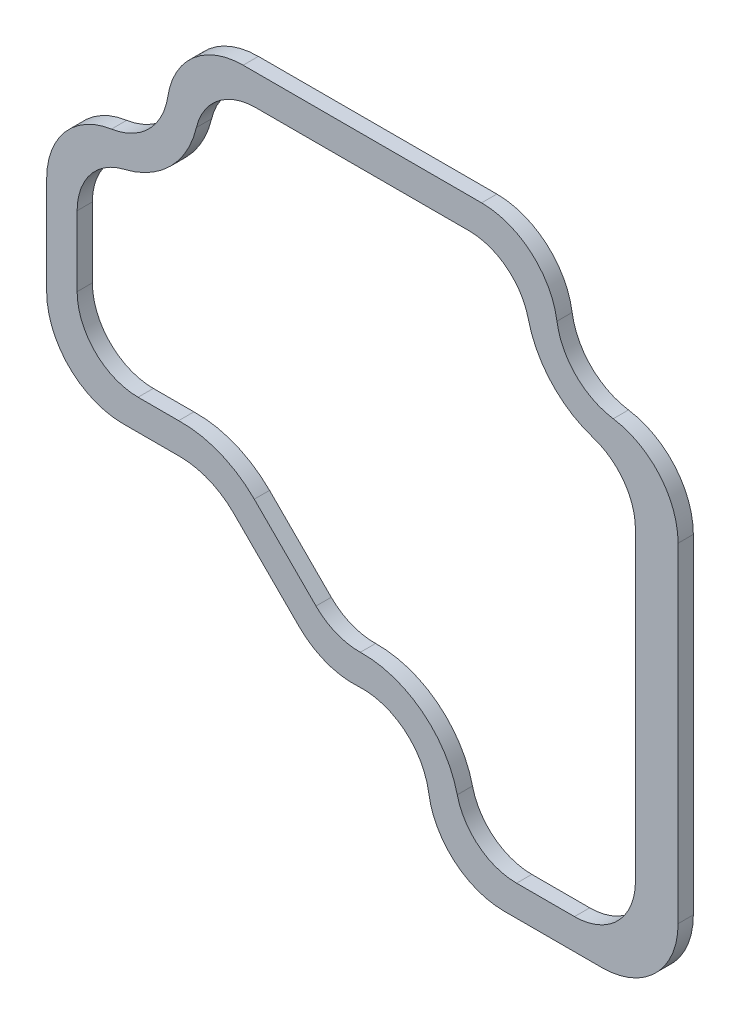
ISO-10303-21;
HEADER;
FILE_DESCRIPTION(('STEP AP214'),'2;1');
FILE_NAME('part.step','',(''),(''),'','','');
FILE_SCHEMA(('AUTOMOTIVE_DESIGN { 1 0 10303 214 1 1 1 1 }'));
ENDSEC;
DATA;
#1=APPLICATION_CONTEXT('core data for automotive mechanical design processes');
#2=APPLICATION_PROTOCOL_DEFINITION('international standard','automotive_design',2000,#1);
#3=PRODUCT_CONTEXT('',#1,'mechanical');
#4=PRODUCT('Part','Part','',(#3));
#5=PRODUCT_RELATED_PRODUCT_CATEGORY('part','',(#4));
#6=PRODUCT_DEFINITION_FORMATION('','',#4);
#7=PRODUCT_DEFINITION_CONTEXT('part definition',#1,'design');
#8=PRODUCT_DEFINITION('design','',#6,#7);
#9=PRODUCT_DEFINITION_SHAPE('','',#8);
#10=(LENGTH_UNIT() NAMED_UNIT(*) SI_UNIT(.MILLI.,.METRE.));
#11=(NAMED_UNIT(*) PLANE_ANGLE_UNIT() SI_UNIT($,.RADIAN.));
#12=(NAMED_UNIT(*) SI_UNIT($,.STERADIAN.) SOLID_ANGLE_UNIT());
#13=UNCERTAINTY_MEASURE_WITH_UNIT(LENGTH_MEASURE(1.E-05),#10,'distance_accuracy_value','');
#14=(GEOMETRIC_REPRESENTATION_CONTEXT(3) GLOBAL_UNCERTAINTY_ASSIGNED_CONTEXT((#13)) GLOBAL_UNIT_ASSIGNED_CONTEXT((#10,
#11,#12)) REPRESENTATION_CONTEXT('',''));
#15=CARTESIAN_POINT('',(0.,0.,0.));
#16=DIRECTION('',(0.,0.,1.));
#17=DIRECTION('',(1.,0.,0.));
#18=AXIS2_PLACEMENT_3D('',#15,#16,#17);
#19=CARTESIAN_POINT('',(24.9555,10.8979334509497,1.5875));
#20=DIRECTION('',(0.,0.,1.));
#21=DIRECTION('',(1.,0.,0.));
#22=AXIS2_PLACEMENT_3D('',#19,#20,#21);
#23=PLANE('',#22);
#24=CARTESIAN_POINT('',(24.9555,10.8979334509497,1.5875));
#25=DIRECTION('',(0.,0.,1.));
#26=DIRECTION('',(1.,0.,0.));
#27=AXIS2_PLACEMENT_3D('',#24,#25,#26);
#28=CIRCLE('',#27,7.9375);
#29=CARTESIAN_POINT('',(32.893,10.8979334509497,1.5875));
#30=VERTEX_POINT('',#29);
#31=CARTESIAN_POINT('',(26.1376808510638,18.7469050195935,1.5875));
#32=VERTEX_POINT('',#31);
#33=EDGE_CURVE('E398',#30,#32,#28,.T.);
#34=ORIENTED_EDGE('',*,*,#33,.T.);
#35=CARTESIAN_POINT('',(27.178,25.654,1.5875));
#36=DIRECTION('',(0.,0.,-1.));
#37=DIRECTION('',(1.,0.,0.));
#38=AXIS2_PLACEMENT_3D('',#35,#36,#37);
#39=CIRCLE('',#38,6.985);
#40=CARTESIAN_POINT('',(20.2709050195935,24.6136808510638,1.5875));
#41=VERTEX_POINT('',#40);
#42=EDGE_CURVE('E403',#32,#41,#39,.T.);
#43=ORIENTED_EDGE('',*,*,#42,.T.);
#44=CARTESIAN_POINT('',(12.4219334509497,23.4315,1.5875));
#45=DIRECTION('',(0.,0.,1.));
#46=DIRECTION('',(1.,0.,0.));
#47=AXIS2_PLACEMENT_3D('',#44,#45,#46);
#48=CIRCLE('',#47,7.93750000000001);
#49=CARTESIAN_POINT('',(12.4219334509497,31.369,1.5875));
#50=VERTEX_POINT('',#49);
#51=EDGE_CURVE('E413',#41,#50,#48,.T.);
#52=ORIENTED_EDGE('',*,*,#51,.T.);
#53=DIRECTION('',(-1.,0.,0.));
#54=VECTOR('',#53,1.);
#55=CARTESIAN_POINT('',(-12.4219334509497,31.369,1.5875));
#56=LINE('',#55,#54);
#57=CARTESIAN_POINT('',(-12.4219334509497,31.369,1.5875));
#58=VERTEX_POINT('',#57);
#59=EDGE_CURVE('E416',#50,#58,#56,.T.);
#60=ORIENTED_EDGE('',*,*,#59,.T.);
#61=CARTESIAN_POINT('',(-12.4219334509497,23.4315,1.5875));
#62=DIRECTION('',(0.,0.,1.));
#63=DIRECTION('',(1.,0.,0.));
#64=AXIS2_PLACEMENT_3D('',#61,#62,#63);
#65=CIRCLE('',#64,7.9375);
#66=CARTESIAN_POINT('',(-20.2709050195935,24.6136808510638,1.5875));
#67=VERTEX_POINT('',#66);
#68=EDGE_CURVE('E420',#58,#67,#65,.T.);
#69=ORIENTED_EDGE('',*,*,#68,.T.);
#70=CARTESIAN_POINT('',(-27.178,25.654,1.5875));
#71=DIRECTION('',(0.,0.,-1.));
#72=DIRECTION('',(1.,0.,0.));
#73=AXIS2_PLACEMENT_3D('',#70,#71,#72);
#74=CIRCLE('',#73,6.985);
#75=CARTESIAN_POINT('',(-26.1376808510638,18.7469050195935,1.5875));
#76=VERTEX_POINT('',#75);
#77=EDGE_CURVE('E424',#67,#76,#74,.T.);
#78=ORIENTED_EDGE('',*,*,#77,.T.);
#79=CARTESIAN_POINT('',(-24.9555,10.8979334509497,1.5875));
#80=DIRECTION('',(0.,0.,1.));
#81=DIRECTION('',(1.,0.,0.));
#82=AXIS2_PLACEMENT_3D('',#79,#80,#81);
#83=CIRCLE('',#82,7.9375);
#84=CARTESIAN_POINT('',(-32.893,10.8979334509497,1.5875));
#85=VERTEX_POINT('',#84);
#86=EDGE_CURVE('E432',#76,#85,#83,.T.);
#87=ORIENTED_EDGE('',*,*,#86,.T.);
#88=DIRECTION('',(0.,-1.,0.));
#89=VECTOR('',#88,1.);
#90=CARTESIAN_POINT('',(-32.893,0.698499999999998,1.5875));
#91=LINE('',#90,#89);
#92=CARTESIAN_POINT('',(-32.893,0.698499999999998,1.5875));
#93=VERTEX_POINT('',#92);
#94=EDGE_CURVE('E435',#85,#93,#91,.T.);
#95=ORIENTED_EDGE('',*,*,#94,.T.);
#96=CARTESIAN_POINT('',(-24.9555,0.698499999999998,1.5875));
#97=DIRECTION('',(0.,0.,1.));
#98=DIRECTION('',(1.,0.,0.));
#99=AXIS2_PLACEMENT_3D('',#96,#97,#98);
#100=CIRCLE('',#99,7.9375);
#101=CARTESIAN_POINT('',(-24.9555,-7.23900000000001,1.5875));
#102=VERTEX_POINT('',#101);
#103=EDGE_CURVE('E439',#93,#102,#100,.T.);
#104=ORIENTED_EDGE('',*,*,#103,.T.);
#105=DIRECTION('',(1.,0.,0.));
#106=VECTOR('',#105,1.);
#107=CARTESIAN_POINT('',(-19.0087433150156,-7.23900000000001,1.5875));
#108=LINE('',#107,#106);
#109=CARTESIAN_POINT('',(-19.0087433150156,-7.23900000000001,1.5875));
#110=VERTEX_POINT('',#109);
#111=EDGE_CURVE('E443',#102,#110,#108,.T.);
#112=ORIENTED_EDGE('',*,*,#111,.T.);
#113=CARTESIAN_POINT('',(-19.0087433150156,-15.1765,1.5875));
#114=DIRECTION('',(0.,0.,-1.));
#115=DIRECTION('',(1.,0.,0.));
#116=AXIS2_PLACEMENT_3D('',#113,#114,#115);
#117=CIRCLE('',#116,7.9375);
#118=CARTESIAN_POINT('',(-13.3960832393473,-9.56383992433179,1.5875));
#119=VERTEX_POINT('',#118);
#120=EDGE_CURVE('E451',#110,#119,#117,.T.);
#121=ORIENTED_EDGE('',*,*,#120,.T.);
#122=DIRECTION('',(0.707106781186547,-0.707106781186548,0.));
#123=VECTOR('',#122,1.);
#124=CARTESIAN_POINT('',(-6.58410903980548,-16.3758141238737,1.5875));
#125=LINE('',#124,#123);
#126=CARTESIAN_POINT('',(-6.58410903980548,-16.3758141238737,1.5875));
#127=VERTEX_POINT('',#126);
#128=EDGE_CURVE('E454',#119,#127,#125,.T.);
#129=ORIENTED_EDGE('',*,*,#128,.T.);
#130=CARTESIAN_POINT('',(-0.971448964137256,-10.7631540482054,1.5875));
#131=DIRECTION('',(0.,0.,1.));
#132=DIRECTION('',(1.,0.,0.));
#133=AXIS2_PLACEMENT_3D('',#130,#131,#132);
#134=CIRCLE('',#133,7.9375);
#135=CARTESIAN_POINT('',(-0.454720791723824,-18.6838167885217,1.5875));
#136=VERTEX_POINT('',#135);
#137=EDGE_CURVE('E458',#127,#136,#134,.T.);
#138=ORIENTED_EDGE('',*,*,#137,.T.);
#139=CARTESIAN_POINT('',(0.,-25.654,1.5875));
#140=DIRECTION('',(0.,0.,-1.));
#141=DIRECTION('',(1.,0.,0.));
#142=AXIS2_PLACEMENT_3D('',#139,#140,#141);
#143=CIRCLE('',#142,6.985);
#144=CARTESIAN_POINT('',(6.9070949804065,-24.6136808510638,1.5875));
#145=VERTEX_POINT('',#144);
#146=EDGE_CURVE('E462',#136,#145,#143,.T.);
#147=ORIENTED_EDGE('',*,*,#146,.T.);
#148=CARTESIAN_POINT('',(14.7560665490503,-23.4315,1.5875));
#149=DIRECTION('',(0.,0.,1.));
#150=DIRECTION('',(1.,0.,0.));
#151=AXIS2_PLACEMENT_3D('',#148,#149,#150);
#152=CIRCLE('',#151,7.9375);
#153=CARTESIAN_POINT('',(14.7560665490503,-31.369,1.5875));
#154=VERTEX_POINT('',#153);
#155=EDGE_CURVE('E469',#145,#154,#152,.T.);
#156=ORIENTED_EDGE('',*,*,#155,.T.);
#157=DIRECTION('',(1.,0.,0.));
#158=VECTOR('',#157,1.);
#159=CARTESIAN_POINT('',(14.7560665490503,-31.369,1.5875));
#160=LINE('',#159,#158);
#161=CARTESIAN_POINT('',(24.9555,-31.369,1.5875));
#162=VERTEX_POINT('',#161);
#163=EDGE_CURVE('E472',#154,#162,#160,.T.);
#164=ORIENTED_EDGE('',*,*,#163,.T.);
#165=CARTESIAN_POINT('',(24.9555,-23.4315,1.5875));
#166=DIRECTION('',(0.,0.,1.));
#167=DIRECTION('',(1.,0.,0.));
#168=AXIS2_PLACEMENT_3D('',#165,#166,#167);
#169=CIRCLE('',#168,7.9375);
#170=CARTESIAN_POINT('',(32.893,-23.4315,1.5875));
#171=VERTEX_POINT('',#170);
#172=EDGE_CURVE('E476',#162,#171,#169,.T.);
#173=ORIENTED_EDGE('',*,*,#172,.T.);
#174=DIRECTION('',(0.,1.,0.));
#175=VECTOR('',#174,1.);
#176=CARTESIAN_POINT('',(32.893,-23.4315,1.5875));
#177=LINE('',#176,#175);
#178=EDGE_CURVE('E479',#171,#30,#177,.T.);
#179=ORIENTED_EDGE('',*,*,#178,.T.);
#180=EDGE_LOOP('',(#34,#43,#52,#60,#69,#78,#87,#95,#104,#112,#121,#129,#138,#147,#156,#164,#173,#179));
#181=FACE_BOUND('',#180,.T.);
#182=DIRECTION('',(0.707106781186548,-0.707106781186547,0.));
#183=VECTOR('',#182,1.);
#184=CARTESIAN_POINT('',(-4.83212451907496,-13.6376705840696,1.5875));
#185=LINE('',#184,#183);
#186=CARTESIAN_POINT('',(-11.2615611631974,-7.20823393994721,1.5875));
#187=VERTEX_POINT('',#186);
#188=CARTESIAN_POINT('',(-4.83212451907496,-13.6376705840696,1.5875));
#189=VERTEX_POINT('',#188);
#190=EDGE_CURVE('E278',#187,#189,#185,.T.);
#191=ORIENTED_EDGE('',*,*,#190,.F.);
#192=CARTESIAN_POINT('',(-18.8612224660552,-14.807895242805,1.5875));
#193=DIRECTION('',(0.,0.,-1.));
#194=DIRECTION('',(1.,0.,0.));
#195=AXIS2_PLACEMENT_3D('',#192,#193,#194);
#196=CIRCLE('',#195,10.7475440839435);
#197=CARTESIAN_POINT('',(-19.1412561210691,-4.064,1.5875));
#198=VERTEX_POINT('',#197);
#199=EDGE_CURVE('E269',#198,#187,#196,.T.);
#200=ORIENTED_EDGE('',*,*,#199,.F.);
#201=DIRECTION('',(1.,0.,0.));
#202=VECTOR('',#201,1.);
#203=CARTESIAN_POINT('',(-19.1412561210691,-4.064,1.5875));
#204=LINE('',#203,#202);
#205=CARTESIAN_POINT('',(-23.368,-4.064,1.5875));
#206=VERTEX_POINT('',#205);
#207=EDGE_CURVE('E311',#206,#198,#204,.T.);
#208=ORIENTED_EDGE('',*,*,#207,.F.);
#209=CARTESIAN_POINT('',(-23.368,2.28599999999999,1.5875));
#210=DIRECTION('',(0.,0.,1.));
#211=DIRECTION('',(-1.,0.,0.));
#212=AXIS2_PLACEMENT_3D('',#209,#210,#211);
#213=CIRCLE('',#212,6.34999999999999);
#214=CARTESIAN_POINT('',(-29.718,2.28599999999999,1.5875));
#215=VERTEX_POINT('',#214);
#216=EDGE_CURVE('E315',#215,#206,#213,.T.);
#217=ORIENTED_EDGE('',*,*,#216,.F.);
#218=DIRECTION('',(0.,-1.,0.));
#219=VECTOR('',#218,1.);
#220=CARTESIAN_POINT('',(-29.718,2.28599999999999,1.5875));
#221=LINE('',#220,#219);
#222=CARTESIAN_POINT('',(-29.718,9.58962948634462,1.5875));
#223=VERTEX_POINT('',#222);
#224=EDGE_CURVE('E980',#223,#215,#221,.T.);
#225=ORIENTED_EDGE('',*,*,#224,.F.);
#226=CARTESIAN_POINT('',(-23.368,9.58962948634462,1.5875));
#227=DIRECTION('',(0.,0.,1.));
#228=DIRECTION('',(-1.,0.,0.));
#229=AXIS2_PLACEMENT_3D('',#226,#227,#228);
#230=CIRCLE('',#229,6.35000000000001);
#231=CARTESIAN_POINT('',(-24.8333846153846,15.7682335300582,1.5875));
#232=VERTEX_POINT('',#231);
#233=EDGE_CURVE('E982',#232,#223,#230,.T.);
#234=ORIENTED_EDGE('',*,*,#233,.F.);
#235=CARTESIAN_POINT('',(-27.178,25.654,1.5875));
#236=DIRECTION('',(0.,0.,-1.));
#237=DIRECTION('',(1.,0.,0.));
#238=AXIS2_PLACEMENT_3D('',#235,#236,#237);
#239=CIRCLE('',#238,10.16);
#240=CARTESIAN_POINT('',(-17.2922335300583,23.3093846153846,1.5875));
#241=VERTEX_POINT('',#240);
#242=EDGE_CURVE('E985',#241,#232,#239,.T.);
#243=ORIENTED_EDGE('',*,*,#242,.F.);
#244=CARTESIAN_POINT('',(-11.1136294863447,21.844,1.5875));
#245=DIRECTION('',(0.,0.,1.));
#246=DIRECTION('',(-1.,0.,0.));
#247=AXIS2_PLACEMENT_3D('',#244,#245,#246);
#248=CIRCLE('',#247,6.34999999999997);
#249=CARTESIAN_POINT('',(-11.1136294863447,28.194,1.5875));
#250=VERTEX_POINT('',#249);
#251=EDGE_CURVE('E997',#250,#241,#248,.T.);
#252=ORIENTED_EDGE('',*,*,#251,.F.);
#253=DIRECTION('',(-1.,0.,0.));
#254=VECTOR('',#253,1.);
#255=CARTESIAN_POINT('',(-11.1136294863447,28.194,1.5875));
#256=LINE('',#255,#254);
#257=CARTESIAN_POINT('',(11.1136294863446,28.194,1.5875));
#258=VERTEX_POINT('',#257);
#259=EDGE_CURVE('E1001',#258,#250,#256,.T.);
#260=ORIENTED_EDGE('',*,*,#259,.F.);
#261=CARTESIAN_POINT('',(11.1136294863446,21.844,1.5875));
#262=DIRECTION('',(0.,0.,1.));
#263=DIRECTION('',(-1.,0.,0.));
#264=AXIS2_PLACEMENT_3D('',#261,#262,#263);
#265=CIRCLE('',#264,6.34999999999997);
#266=CARTESIAN_POINT('',(17.2922335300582,23.3093846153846,1.5875));
#267=VERTEX_POINT('',#266);
#268=EDGE_CURVE('E1005',#267,#258,#265,.T.);
#269=ORIENTED_EDGE('',*,*,#268,.F.);
#270=CARTESIAN_POINT('',(27.1779999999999,25.654,1.5875));
#271=DIRECTION('',(0.,0.,-1.));
#272=DIRECTION('',(1.,0.,0.));
#273=AXIS2_PLACEMENT_3D('',#270,#271,#272);
#274=CIRCLE('',#273,10.16);
#275=CARTESIAN_POINT('',(24.0518461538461,15.9869031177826,1.5875));
#276=VERTEX_POINT('',#275);
#277=EDGE_CURVE('E1013',#276,#267,#274,.T.);
#278=ORIENTED_EDGE('',*,*,#277,.F.);
#279=CARTESIAN_POINT('',(22.098,9.94496756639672,1.5875));
#280=DIRECTION('',(0.,0.,1.));
#281=DIRECTION('',(-1.,0.,0.));
#282=AXIS2_PLACEMENT_3D('',#279,#280,#281);
#283=CIRCLE('',#282,6.34999999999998);
#284=CARTESIAN_POINT('',(28.448,9.94496756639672,1.5875));
#285=VERTEX_POINT('',#284);
#286=EDGE_CURVE('E1016',#285,#276,#283,.T.);
#287=ORIENTED_EDGE('',*,*,#286,.F.);
#288=DIRECTION('',(0.,1.,0.));
#289=VECTOR('',#288,1.);
#290=CARTESIAN_POINT('',(28.448,9.94496756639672,1.5875));
#291=LINE('',#290,#289);
#292=CARTESIAN_POINT('',(28.448,-21.844,1.5875));
#293=VERTEX_POINT('',#292);
#294=EDGE_CURVE('E1020',#293,#285,#291,.T.);
#295=ORIENTED_EDGE('',*,*,#294,.F.);
#296=CARTESIAN_POINT('',(22.098,-21.844,1.5875));
#297=DIRECTION('',(0.,0.,1.));
#298=DIRECTION('',(-1.,0.,0.));
#299=AXIS2_PLACEMENT_3D('',#296,#297,#298);
#300=CIRCLE('',#299,6.34999999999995);
#301=CARTESIAN_POINT('',(22.098,-28.194,1.5875));
#302=VERTEX_POINT('',#301);
#303=EDGE_CURVE('E1024',#302,#293,#300,.T.);
#304=ORIENTED_EDGE('',*,*,#303,.F.);
#305=DIRECTION('',(1.,0.,0.));
#306=VECTOR('',#305,1.);
#307=CARTESIAN_POINT('',(22.098,-28.194,1.5875));
#308=LINE('',#307,#306);
#309=CARTESIAN_POINT('',(16.0643705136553,-28.194,1.5875));
#310=VERTEX_POINT('',#309);
#311=EDGE_CURVE('E1031',#310,#302,#308,.T.);
#312=ORIENTED_EDGE('',*,*,#311,.F.);
#313=CARTESIAN_POINT('',(16.0643705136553,-21.844,1.5875));
#314=DIRECTION('',(0.,0.,1.));
#315=DIRECTION('',(-1.,0.,0.));
#316=AXIS2_PLACEMENT_3D('',#313,#314,#315);
#317=CIRCLE('',#316,6.35);
#318=CARTESIAN_POINT('',(9.88576646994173,-23.3093846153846,1.5875));
#319=VERTEX_POINT('',#318);
#320=EDGE_CURVE('E1034',#319,#310,#317,.T.);
#321=ORIENTED_EDGE('',*,*,#320,.F.);
#322=CARTESIAN_POINT('',(0.,-25.654,1.5875));
#323=DIRECTION('',(0.,0.,-1.));
#324=DIRECTION('',(1.,0.,0.));
#325=AXIS2_PLACEMENT_3D('',#322,#323,#324);
#326=CIRCLE('',#325,10.16);
#327=CARTESIAN_POINT('',(-0.21045935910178,-15.4961800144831,1.5875));
#328=VERTEX_POINT('',#327);
#329=EDGE_CURVE('E296',#328,#319,#326,.T.);
#330=ORIENTED_EDGE('',*,*,#329,.F.);
#331=CARTESIAN_POINT('',(-0.341996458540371,-9.147542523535,1.5875));
#332=DIRECTION('',(0.,0.,1.));
#333=DIRECTION('',(-1.,0.,0.));
#334=AXIS2_PLACEMENT_3D('',#331,#332,#333);
#335=CIRCLE('',#334,6.35000000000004);
#336=EDGE_CURVE('E291',#189,#328,#335,.T.);
#337=ORIENTED_EDGE('',*,*,#336,.F.);
#338=EDGE_LOOP('',(#191,#200,#208,#217,#225,#234,#243,#252,#260,#269,#278,#287,#295,#304,#312,
#321,#330,#337));
#339=FACE_BOUND('',#338,.T.);
#340=ADVANCED_FACE('F36',(#181,#339),#23,.T.);
#341=CARTESIAN_POINT('',(24.9555,10.8979334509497,0.));
#342=DIRECTION('',(0.,0.,1.));
#343=DIRECTION('',(1.,0.,0.));
#344=AXIS2_PLACEMENT_3D('',#341,#342,#343);
#345=PLANE('',#344);
#346=CARTESIAN_POINT('',(24.9555,10.8979334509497,0.));
#347=DIRECTION('',(0.,0.,1.));
#348=DIRECTION('',(1.,0.,0.));
#349=AXIS2_PLACEMENT_3D('',#346,#347,#348);
#350=CIRCLE('',#349,7.9375);
#351=CARTESIAN_POINT('',(32.893,10.8979334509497,0.));
#352=VERTEX_POINT('',#351);
#353=CARTESIAN_POINT('',(26.1376808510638,18.7469050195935,0.));
#354=VERTEX_POINT('',#353);
#355=EDGE_CURVE('E286',#352,#354,#350,.T.);
#356=ORIENTED_EDGE('',*,*,#355,.F.);
#357=DIRECTION('',(0.,1.,0.));
#358=VECTOR('',#357,1.);
#359=CARTESIAN_POINT('',(32.893,-23.4315,0.));
#360=LINE('',#359,#358);
#361=CARTESIAN_POINT('',(32.893,-23.4315,0.));
#362=VERTEX_POINT('',#361);
#363=EDGE_CURVE('E404',#362,#352,#360,.T.);
#364=ORIENTED_EDGE('',*,*,#363,.F.);
#365=CARTESIAN_POINT('',(24.9555,-23.4315,0.));
#366=DIRECTION('',(0.,0.,1.));
#367=DIRECTION('',(1.,0.,0.));
#368=AXIS2_PLACEMENT_3D('',#365,#366,#367);
#369=CIRCLE('',#368,7.9375);
#370=CARTESIAN_POINT('',(24.9555,-31.369,0.));
#371=VERTEX_POINT('',#370);
#372=EDGE_CURVE('E515',#371,#362,#369,.T.);
#373=ORIENTED_EDGE('',*,*,#372,.F.);
#374=DIRECTION('',(1.,0.,0.));
#375=VECTOR('',#374,1.);
#376=CARTESIAN_POINT('',(14.7560665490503,-31.369,0.));
#377=LINE('',#376,#375);
#378=CARTESIAN_POINT('',(14.7560665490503,-31.369,0.));
#379=VERTEX_POINT('',#378);
#380=EDGE_CURVE('E513',#379,#371,#377,.T.);
#381=ORIENTED_EDGE('',*,*,#380,.F.);
#382=CARTESIAN_POINT('',(14.7560665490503,-23.4315,0.));
#383=DIRECTION('',(0.,0.,1.));
#384=DIRECTION('',(1.,0.,0.));
#385=AXIS2_PLACEMENT_3D('',#382,#383,#384);
#386=CIRCLE('',#385,7.9375);
#387=CARTESIAN_POINT('',(6.9070949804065,-24.6136808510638,0.));
#388=VERTEX_POINT('',#387);
#389=EDGE_CURVE('E511',#388,#379,#386,.T.);
#390=ORIENTED_EDGE('',*,*,#389,.F.);
#391=CARTESIAN_POINT('',(0.,-25.654,0.));
#392=DIRECTION('',(0.,0.,-1.));
#393=DIRECTION('',(1.,0.,0.));
#394=AXIS2_PLACEMENT_3D('',#391,#392,#393);
#395=CIRCLE('',#394,6.985);
#396=CARTESIAN_POINT('',(-0.454720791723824,-18.6838167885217,0.));
#397=VERTEX_POINT('',#396);
#398=EDGE_CURVE('E509',#397,#388,#395,.T.);
#399=ORIENTED_EDGE('',*,*,#398,.F.);
#400=CARTESIAN_POINT('',(-0.971448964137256,-10.7631540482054,0.));
#401=DIRECTION('',(0.,0.,1.));
#402=DIRECTION('',(1.,0.,0.));
#403=AXIS2_PLACEMENT_3D('',#400,#401,#402);
#404=CIRCLE('',#403,7.9375);
#405=CARTESIAN_POINT('',(-6.58410903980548,-16.3758141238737,0.));
#406=VERTEX_POINT('',#405);
#407=EDGE_CURVE('E507',#406,#397,#404,.T.);
#408=ORIENTED_EDGE('',*,*,#407,.F.);
#409=DIRECTION('',(0.707106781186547,-0.707106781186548,0.));
#410=VECTOR('',#409,1.);
#411=CARTESIAN_POINT('',(-6.58410903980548,-16.3758141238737,0.));
#412=LINE('',#411,#410);
#413=CARTESIAN_POINT('',(-13.3960832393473,-9.56383992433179,0.));
#414=VERTEX_POINT('',#413);
#415=EDGE_CURVE('E505',#414,#406,#412,.T.);
#416=ORIENTED_EDGE('',*,*,#415,.F.);
#417=CARTESIAN_POINT('',(-19.0087433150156,-15.1765,0.));
#418=DIRECTION('',(0.,0.,-1.));
#419=DIRECTION('',(1.,0.,0.));
#420=AXIS2_PLACEMENT_3D('',#417,#418,#419);
#421=CIRCLE('',#420,7.9375);
#422=CARTESIAN_POINT('',(-19.0087433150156,-7.23900000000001,0.));
#423=VERTEX_POINT('',#422);
#424=EDGE_CURVE('E503',#423,#414,#421,.T.);
#425=ORIENTED_EDGE('',*,*,#424,.F.);
#426=DIRECTION('',(1.,0.,0.));
#427=VECTOR('',#426,1.);
#428=CARTESIAN_POINT('',(-19.0087433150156,-7.23900000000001,0.));
#429=LINE('',#428,#427);
#430=CARTESIAN_POINT('',(-24.9555,-7.23900000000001,0.));
#431=VERTEX_POINT('',#430);
#432=EDGE_CURVE('E501',#431,#423,#429,.T.);
#433=ORIENTED_EDGE('',*,*,#432,.F.);
#434=CARTESIAN_POINT('',(-24.9555,0.698499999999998,0.));
#435=DIRECTION('',(0.,0.,1.));
#436=DIRECTION('',(1.,0.,0.));
#437=AXIS2_PLACEMENT_3D('',#434,#435,#436);
#438=CIRCLE('',#437,7.9375);
#439=CARTESIAN_POINT('',(-32.893,0.698499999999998,0.));
#440=VERTEX_POINT('',#439);
#441=EDGE_CURVE('E499',#440,#431,#438,.T.);
#442=ORIENTED_EDGE('',*,*,#441,.F.);
#443=DIRECTION('',(0.,-1.,0.));
#444=VECTOR('',#443,1.);
#445=CARTESIAN_POINT('',(-32.893,0.698499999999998,0.));
#446=LINE('',#445,#444);
#447=CARTESIAN_POINT('',(-32.893,10.8979334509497,0.));
#448=VERTEX_POINT('',#447);
#449=EDGE_CURVE('E497',#448,#440,#446,.T.);
#450=ORIENTED_EDGE('',*,*,#449,.F.);
#451=CARTESIAN_POINT('',(-24.9555,10.8979334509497,0.));
#452=DIRECTION('',(0.,0.,1.));
#453=DIRECTION('',(1.,0.,0.));
#454=AXIS2_PLACEMENT_3D('',#451,#452,#453);
#455=CIRCLE('',#454,7.9375);
#456=CARTESIAN_POINT('',(-26.1376808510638,18.7469050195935,0.));
#457=VERTEX_POINT('',#456);
#458=EDGE_CURVE('E495',#457,#448,#455,.T.);
#459=ORIENTED_EDGE('',*,*,#458,.F.);
#460=CARTESIAN_POINT('',(-27.178,25.654,0.));
#461=DIRECTION('',(0.,0.,-1.));
#462=DIRECTION('',(1.,0.,0.));
#463=AXIS2_PLACEMENT_3D('',#460,#461,#462);
#464=CIRCLE('',#463,6.985);
#465=CARTESIAN_POINT('',(-20.2709050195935,24.6136808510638,0.));
#466=VERTEX_POINT('',#465);
#467=EDGE_CURVE('E493',#466,#457,#464,.T.);
#468=ORIENTED_EDGE('',*,*,#467,.F.);
#469=CARTESIAN_POINT('',(-12.4219334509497,23.4315,0.));
#470=DIRECTION('',(0.,0.,1.));
#471=DIRECTION('',(1.,0.,0.));
#472=AXIS2_PLACEMENT_3D('',#469,#470,#471);
#473=CIRCLE('',#472,7.9375);
#474=CARTESIAN_POINT('',(-12.4219334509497,31.369,0.));
#475=VERTEX_POINT('',#474);
#476=EDGE_CURVE('E491',#475,#466,#473,.T.);
#477=ORIENTED_EDGE('',*,*,#476,.F.);
#478=DIRECTION('',(-1.,0.,0.));
#479=VECTOR('',#478,1.);
#480=CARTESIAN_POINT('',(-12.4219334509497,31.369,0.));
#481=LINE('',#480,#479);
#482=CARTESIAN_POINT('',(12.4219334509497,31.369,0.));
#483=VERTEX_POINT('',#482);
#484=EDGE_CURVE('E489',#483,#475,#481,.T.);
#485=ORIENTED_EDGE('',*,*,#484,.F.);
#486=CARTESIAN_POINT('',(12.4219334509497,23.4315,0.));
#487=DIRECTION('',(0.,0.,1.));
#488=DIRECTION('',(1.,0.,0.));
#489=AXIS2_PLACEMENT_3D('',#486,#487,#488);
#490=CIRCLE('',#489,7.93750000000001);
#491=CARTESIAN_POINT('',(20.2709050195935,24.6136808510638,0.));
#492=VERTEX_POINT('',#491);
#493=EDGE_CURVE('E487',#492,#483,#490,.T.);
#494=ORIENTED_EDGE('',*,*,#493,.F.);
#495=CARTESIAN_POINT('',(27.178,25.654,0.));
#496=DIRECTION('',(0.,0.,-1.));
#497=DIRECTION('',(1.,0.,0.));
#498=AXIS2_PLACEMENT_3D('',#495,#496,#497);
#499=CIRCLE('',#498,6.985);
#500=EDGE_CURVE('E485',#354,#492,#499,.T.);
#501=ORIENTED_EDGE('',*,*,#500,.F.);
#502=EDGE_LOOP('',(#356,#364,#373,#381,#390,#399,#408,#416,#425,#433,#442,#450,#459,#468,#477,
#485,#494,#501));
#503=FACE_BOUND('',#502,.T.);
#504=CARTESIAN_POINT('',(-18.8612224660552,-14.807895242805,0.));
#505=DIRECTION('',(0.,0.,-1.));
#506=DIRECTION('',(1.,0.,0.));
#507=AXIS2_PLACEMENT_3D('',#504,#505,#506);
#508=CIRCLE('',#507,10.7475440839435);
#509=CARTESIAN_POINT('',(-19.1412561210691,-4.064,0.));
#510=VERTEX_POINT('',#509);
#511=CARTESIAN_POINT('',(-11.2615611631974,-7.20823393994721,0.));
#512=VERTEX_POINT('',#511);
#513=EDGE_CURVE('E59',#510,#512,#508,.T.);
#514=ORIENTED_EDGE('',*,*,#513,.T.);
#515=DIRECTION('',(0.707106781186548,-0.707106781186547,0.));
#516=VECTOR('',#515,1.);
#517=CARTESIAN_POINT('',(-4.83212451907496,-13.6376705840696,0.));
#518=LINE('',#517,#516);
#519=CARTESIAN_POINT('',(-4.83212451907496,-13.6376705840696,0.));
#520=VERTEX_POINT('',#519);
#521=EDGE_CURVE('E285',#512,#520,#518,.T.);
#522=ORIENTED_EDGE('',*,*,#521,.T.);
#523=CARTESIAN_POINT('',(-0.341996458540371,-9.147542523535,0.));
#524=DIRECTION('',(0.,0.,1.));
#525=DIRECTION('',(-1.,0.,0.));
#526=AXIS2_PLACEMENT_3D('',#523,#524,#525);
#527=CIRCLE('',#526,6.35000000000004);
#528=CARTESIAN_POINT('',(-0.21045935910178,-15.4961800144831,0.));
#529=VERTEX_POINT('',#528);
#530=EDGE_CURVE('E320',#520,#529,#527,.T.);
#531=ORIENTED_EDGE('',*,*,#530,.T.);
#532=CARTESIAN_POINT('',(0.,-25.654,0.));
#533=DIRECTION('',(0.,0.,-1.));
#534=DIRECTION('',(1.,0.,0.));
#535=AXIS2_PLACEMENT_3D('',#532,#533,#534);
#536=CIRCLE('',#535,10.16);
#537=CARTESIAN_POINT('',(9.88576646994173,-23.3093846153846,0.));
#538=VERTEX_POINT('',#537);
#539=EDGE_CURVE('E323',#529,#538,#536,.T.);
#540=ORIENTED_EDGE('',*,*,#539,.T.);
#541=CARTESIAN_POINT('',(16.0643705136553,-21.844,0.));
#542=DIRECTION('',(0.,0.,1.));
#543=DIRECTION('',(-1.,0.,0.));
#544=AXIS2_PLACEMENT_3D('',#541,#542,#543);
#545=CIRCLE('',#544,6.35);
#546=CARTESIAN_POINT('',(16.0643705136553,-28.194,0.));
#547=VERTEX_POINT('',#546);
#548=EDGE_CURVE('E326',#538,#547,#545,.T.);
#549=ORIENTED_EDGE('',*,*,#548,.T.);
#550=DIRECTION('',(1.,0.,0.));
#551=VECTOR('',#550,1.);
#552=CARTESIAN_POINT('',(22.098,-28.194,0.));
#553=LINE('',#552,#551);
#554=CARTESIAN_POINT('',(22.098,-28.194,0.));
#555=VERTEX_POINT('',#554);
#556=EDGE_CURVE('E329',#547,#555,#553,.T.);
#557=ORIENTED_EDGE('',*,*,#556,.T.);
#558=CARTESIAN_POINT('',(22.098,-21.844,0.));
#559=DIRECTION('',(0.,0.,1.));
#560=DIRECTION('',(-1.,0.,0.));
#561=AXIS2_PLACEMENT_3D('',#558,#559,#560);
#562=CIRCLE('',#561,6.34999999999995);
#563=CARTESIAN_POINT('',(28.448,-21.844,0.));
#564=VERTEX_POINT('',#563);
#565=EDGE_CURVE('E332',#555,#564,#562,.T.);
#566=ORIENTED_EDGE('',*,*,#565,.T.);
#567=DIRECTION('',(0.,1.,0.));
#568=VECTOR('',#567,1.);
#569=CARTESIAN_POINT('',(28.448,9.94496756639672,0.));
#570=LINE('',#569,#568);
#571=CARTESIAN_POINT('',(28.448,9.94496756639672,0.));
#572=VERTEX_POINT('',#571);
#573=EDGE_CURVE('E335',#564,#572,#570,.T.);
#574=ORIENTED_EDGE('',*,*,#573,.T.);
#575=CARTESIAN_POINT('',(22.098,9.94496756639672,0.));
#576=DIRECTION('',(0.,0.,1.));
#577=DIRECTION('',(-1.,0.,0.));
#578=AXIS2_PLACEMENT_3D('',#575,#576,#577);
#579=CIRCLE('',#578,6.34999999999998);
#580=CARTESIAN_POINT('',(24.0518461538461,15.9869031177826,0.));
#581=VERTEX_POINT('',#580);
#582=EDGE_CURVE('E338',#572,#581,#579,.T.);
#583=ORIENTED_EDGE('',*,*,#582,.T.);
#584=CARTESIAN_POINT('',(27.1779999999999,25.654,0.));
#585=DIRECTION('',(0.,0.,-1.));
#586=DIRECTION('',(1.,0.,0.));
#587=AXIS2_PLACEMENT_3D('',#584,#585,#586);
#588=CIRCLE('',#587,10.16);
#589=CARTESIAN_POINT('',(17.2922335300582,23.3093846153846,0.));
#590=VERTEX_POINT('',#589);
#591=EDGE_CURVE('E341',#581,#590,#588,.T.);
#592=ORIENTED_EDGE('',*,*,#591,.T.);
#593=CARTESIAN_POINT('',(11.1136294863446,21.844,0.));
#594=DIRECTION('',(0.,0.,1.));
#595=DIRECTION('',(-1.,0.,0.));
#596=AXIS2_PLACEMENT_3D('',#593,#594,#595);
#597=CIRCLE('',#596,6.34999999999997);
#598=CARTESIAN_POINT('',(11.1136294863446,28.194,0.));
#599=VERTEX_POINT('',#598);
#600=EDGE_CURVE('E344',#590,#599,#597,.T.);
#601=ORIENTED_EDGE('',*,*,#600,.T.);
#602=DIRECTION('',(-1.,0.,0.));
#603=VECTOR('',#602,1.);
#604=CARTESIAN_POINT('',(-11.1136294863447,28.194,0.));
#605=LINE('',#604,#603);
#606=CARTESIAN_POINT('',(-11.1136294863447,28.194,0.));
#607=VERTEX_POINT('',#606);
#608=EDGE_CURVE('E347',#599,#607,#605,.T.);
#609=ORIENTED_EDGE('',*,*,#608,.T.);
#610=CARTESIAN_POINT('',(-11.1136294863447,21.844,0.));
#611=DIRECTION('',(0.,0.,1.));
#612=DIRECTION('',(-1.,0.,0.));
#613=AXIS2_PLACEMENT_3D('',#610,#611,#612);
#614=CIRCLE('',#613,6.34999999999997);
#615=CARTESIAN_POINT('',(-17.2922335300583,23.3093846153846,0.));
#616=VERTEX_POINT('',#615);
#617=EDGE_CURVE('E350',#607,#616,#614,.T.);
#618=ORIENTED_EDGE('',*,*,#617,.T.);
#619=CARTESIAN_POINT('',(-27.178,25.654,0.));
#620=DIRECTION('',(0.,0.,-1.));
#621=DIRECTION('',(1.,0.,0.));
#622=AXIS2_PLACEMENT_3D('',#619,#620,#621);
#623=CIRCLE('',#622,10.16);
#624=CARTESIAN_POINT('',(-24.8333846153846,15.7682335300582,0.));
#625=VERTEX_POINT('',#624);
#626=EDGE_CURVE('E353',#616,#625,#623,.T.);
#627=ORIENTED_EDGE('',*,*,#626,.T.);
#628=CARTESIAN_POINT('',(-23.368,9.58962948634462,0.));
#629=DIRECTION('',(0.,0.,1.));
#630=DIRECTION('',(-1.,0.,0.));
#631=AXIS2_PLACEMENT_3D('',#628,#629,#630);
#632=CIRCLE('',#631,6.35000000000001);
#633=CARTESIAN_POINT('',(-29.718,9.58962948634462,0.));
#634=VERTEX_POINT('',#633);
#635=EDGE_CURVE('E356',#625,#634,#632,.T.);
#636=ORIENTED_EDGE('',*,*,#635,.T.);
#637=DIRECTION('',(0.,-1.,0.));
#638=VECTOR('',#637,1.);
#639=CARTESIAN_POINT('',(-29.718,2.28599999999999,0.));
#640=LINE('',#639,#638);
#641=CARTESIAN_POINT('',(-29.718,2.28599999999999,0.));
#642=VERTEX_POINT('',#641);
#643=EDGE_CURVE('E359',#634,#642,#640,.T.);
#644=ORIENTED_EDGE('',*,*,#643,.T.);
#645=CARTESIAN_POINT('',(-23.368,2.28599999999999,0.));
#646=DIRECTION('',(0.,0.,1.));
#647=DIRECTION('',(-1.,0.,0.));
#648=AXIS2_PLACEMENT_3D('',#645,#646,#647);
#649=CIRCLE('',#648,6.34999999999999);
#650=CARTESIAN_POINT('',(-23.368,-4.064,0.));
#651=VERTEX_POINT('',#650);
#652=EDGE_CURVE('E362',#642,#651,#649,.T.);
#653=ORIENTED_EDGE('',*,*,#652,.T.);
#654=DIRECTION('',(1.,0.,0.));
#655=VECTOR('',#654,1.);
#656=CARTESIAN_POINT('',(-19.1412561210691,-4.064,0.));
#657=LINE('',#656,#655);
#658=EDGE_CURVE('E279',#651,#510,#657,.T.);
#659=ORIENTED_EDGE('',*,*,#658,.T.);
#660=EDGE_LOOP('',(#514,#522,#531,#540,#549,#557,#566,#574,#583,#592,#601,#609,#618,#627,#636,
#644,#653,#659));
#661=FACE_BOUND('',#660,.T.);
#662=ADVANCED_FACE('F575',(#503,#661),#345,.F.);
#663=CARTESIAN_POINT('',(24.9555,10.8979334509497,1.5875));
#664=DIRECTION('',(0.,0.,-1.));
#665=DIRECTION('',(-1.,0.,0.));
#666=AXIS2_PLACEMENT_3D('',#663,#664,#665);
#667=CYLINDRICAL_SURFACE('',#666,7.9375);
#668=ORIENTED_EDGE('',*,*,#355,.T.);
#669=DIRECTION('',(0.,0.,-1.));
#670=VECTOR('',#669,1.);
#671=CARTESIAN_POINT('',(26.1376808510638,18.7469050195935,1.5875));
#672=LINE('',#671,#670);
#673=EDGE_CURVE('E12',#32,#354,#672,.T.);
#674=ORIENTED_EDGE('',*,*,#673,.F.);
#675=ORIENTED_EDGE('',*,*,#33,.F.);
#676=DIRECTION('',(0.,0.,-1.));
#677=VECTOR('',#676,1.);
#678=CARTESIAN_POINT('',(32.893,10.8979334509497,1.5875));
#679=LINE('',#678,#677);
#680=EDGE_CURVE('E482',#30,#352,#679,.T.);
#681=ORIENTED_EDGE('',*,*,#680,.T.);
#682=EDGE_LOOP('',(#668,#674,#675,#681));
#683=FACE_BOUND('',#682,.T.);
#684=ADVANCED_FACE('F38',(#683),#667,.T.);
#685=CARTESIAN_POINT('',(27.178,25.654,1.5875));
#686=DIRECTION('',(0.,0.,-1.));
#687=DIRECTION('',(-1.,0.,0.));
#688=AXIS2_PLACEMENT_3D('',#685,#686,#687);
#689=CYLINDRICAL_SURFACE('',#688,6.985);
#690=ORIENTED_EDGE('',*,*,#500,.T.);
#691=DIRECTION('',(0.,0.,-1.));
#692=VECTOR('',#691,1.);
#693=CARTESIAN_POINT('',(20.2709050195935,24.6136808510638,1.5875));
#694=LINE('',#693,#692);
#695=EDGE_CURVE('E44',#41,#492,#694,.T.);
#696=ORIENTED_EDGE('',*,*,#695,.F.);
#697=ORIENTED_EDGE('',*,*,#42,.F.);
#698=ORIENTED_EDGE('',*,*,#673,.T.);
#699=EDGE_LOOP('',(#690,#696,#697,#698));
#700=FACE_BOUND('',#699,.T.);
#701=ADVANCED_FACE('F624',(#700),#689,.F.);
#702=CARTESIAN_POINT('',(12.4219334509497,23.4315,1.5875));
#703=DIRECTION('',(0.,0.,-1.));
#704=DIRECTION('',(-1.,0.,0.));
#705=AXIS2_PLACEMENT_3D('',#702,#703,#704);
#706=CYLINDRICAL_SURFACE('',#705,7.93750000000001);
#707=ORIENTED_EDGE('',*,*,#493,.T.);
#708=DIRECTION('',(0.,0.,-1.));
#709=VECTOR('',#708,1.);
#710=CARTESIAN_POINT('',(12.4219334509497,31.369,1.5875));
#711=LINE('',#710,#709);
#712=EDGE_CURVE('E562',#50,#483,#711,.T.);
#713=ORIENTED_EDGE('',*,*,#712,.F.);
#714=ORIENTED_EDGE('',*,*,#51,.F.);
#715=ORIENTED_EDGE('',*,*,#695,.T.);
#716=EDGE_LOOP('',(#707,#713,#714,#715));
#717=FACE_BOUND('',#716,.T.);
#718=ADVANCED_FACE('F569',(#717),#706,.T.);
#719=CARTESIAN_POINT('',(-12.4219334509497,31.369,1.5875));
#720=DIRECTION('',(0.,-1.,0.));
#721=DIRECTION('',(1.,0.,0.));
#722=AXIS2_PLACEMENT_3D('',#719,#720,#721);
#723=PLANE('',#722);
#724=ORIENTED_EDGE('',*,*,#484,.T.);
#725=DIRECTION('',(0.,0.,-1.));
#726=VECTOR('',#725,1.);
#727=CARTESIAN_POINT('',(-12.4219334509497,31.369,1.5875));
#728=LINE('',#727,#726);
#729=EDGE_CURVE('E559',#58,#475,#728,.T.);
#730=ORIENTED_EDGE('',*,*,#729,.F.);
#731=ORIENTED_EDGE('',*,*,#59,.F.);
#732=ORIENTED_EDGE('',*,*,#712,.T.);
#733=EDGE_LOOP('',(#724,#730,#731,#732));
#734=FACE_BOUND('',#733,.T.);
#735=ADVANCED_FACE('F581',(#734),#723,.F.);
#736=CARTESIAN_POINT('',(-12.4219334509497,23.4315,1.5875));
#737=DIRECTION('',(0.,0.,-1.));
#738=DIRECTION('',(-1.,0.,0.));
#739=AXIS2_PLACEMENT_3D('',#736,#737,#738);
#740=CYLINDRICAL_SURFACE('',#739,7.9375);
#741=ORIENTED_EDGE('',*,*,#476,.T.);
#742=DIRECTION('',(0.,0.,-1.));
#743=VECTOR('',#742,1.);
#744=CARTESIAN_POINT('',(-20.2709050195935,24.6136808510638,1.5875));
#745=LINE('',#744,#743);
#746=EDGE_CURVE('E556',#67,#466,#745,.T.);
#747=ORIENTED_EDGE('',*,*,#746,.F.);
#748=ORIENTED_EDGE('',*,*,#68,.F.);
#749=ORIENTED_EDGE('',*,*,#729,.T.);
#750=EDGE_LOOP('',(#741,#747,#748,#749));
#751=FACE_BOUND('',#750,.T.);
#752=ADVANCED_FACE('F585',(#751),#740,.T.);
#753=CARTESIAN_POINT('',(-27.178,25.654,1.5875));
#754=DIRECTION('',(0.,0.,-1.));
#755=DIRECTION('',(-1.,0.,0.));
#756=AXIS2_PLACEMENT_3D('',#753,#754,#755);
#757=CYLINDRICAL_SURFACE('',#756,6.985);
#758=ORIENTED_EDGE('',*,*,#467,.T.);
#759=DIRECTION('',(0.,0.,-1.));
#760=VECTOR('',#759,1.);
#761=CARTESIAN_POINT('',(-26.1376808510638,18.7469050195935,1.5875));
#762=LINE('',#761,#760);
#763=EDGE_CURVE('E553',#76,#457,#762,.T.);
#764=ORIENTED_EDGE('',*,*,#763,.F.);
#765=ORIENTED_EDGE('',*,*,#77,.F.);
#766=ORIENTED_EDGE('',*,*,#746,.T.);
#767=EDGE_LOOP('',(#758,#764,#765,#766));
#768=FACE_BOUND('',#767,.T.);
#769=ADVANCED_FACE('F677',(#768),#757,.F.);
#770=CARTESIAN_POINT('',(-24.9555,10.8979334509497,1.5875));
#771=DIRECTION('',(0.,0.,-1.));
#772=DIRECTION('',(-1.,0.,0.));
#773=AXIS2_PLACEMENT_3D('',#770,#771,#772);
#774=CYLINDRICAL_SURFACE('',#773,7.9375);
#775=ORIENTED_EDGE('',*,*,#458,.T.);
#776=DIRECTION('',(0.,0.,-1.));
#777=VECTOR('',#776,1.);
#778=CARTESIAN_POINT('',(-32.893,10.8979334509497,1.5875));
#779=LINE('',#778,#777);
#780=EDGE_CURVE('E550',#85,#448,#779,.T.);
#781=ORIENTED_EDGE('',*,*,#780,.F.);
#782=ORIENTED_EDGE('',*,*,#86,.F.);
#783=ORIENTED_EDGE('',*,*,#763,.T.);
#784=EDGE_LOOP('',(#775,#781,#782,#783));
#785=FACE_BOUND('',#784,.T.);
#786=ADVANCED_FACE('F673',(#785),#774,.T.);
#787=CARTESIAN_POINT('',(-32.893,0.698499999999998,1.5875));
#788=DIRECTION('',(1.,0.,0.));
#789=DIRECTION('',(0.,0.,-1.));
#790=AXIS2_PLACEMENT_3D('',#787,#788,#789);
#791=PLANE('',#790);
#792=ORIENTED_EDGE('',*,*,#449,.T.);
#793=DIRECTION('',(0.,0.,-1.));
#794=VECTOR('',#793,1.);
#795=CARTESIAN_POINT('',(-32.893,0.698499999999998,1.5875));
#796=LINE('',#795,#794);
#797=EDGE_CURVE('E547',#93,#440,#796,.T.);
#798=ORIENTED_EDGE('',*,*,#797,.F.);
#799=ORIENTED_EDGE('',*,*,#94,.F.);
#800=ORIENTED_EDGE('',*,*,#780,.T.);
#801=EDGE_LOOP('',(#792,#798,#799,#800));
#802=FACE_BOUND('',#801,.T.);
#803=ADVANCED_FACE('F669',(#802),#791,.F.);
#804=CARTESIAN_POINT('',(-24.9555,0.698499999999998,1.5875));
#805=DIRECTION('',(0.,0.,-1.));
#806=DIRECTION('',(-1.,0.,0.));
#807=AXIS2_PLACEMENT_3D('',#804,#805,#806);
#808=CYLINDRICAL_SURFACE('',#807,7.9375);
#809=ORIENTED_EDGE('',*,*,#441,.T.);
#810=DIRECTION('',(0.,0.,-1.));
#811=VECTOR('',#810,1.);
#812=CARTESIAN_POINT('',(-24.9555,-7.23900000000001,1.5875));
#813=LINE('',#812,#811);
#814=EDGE_CURVE('E544',#102,#431,#813,.T.);
#815=ORIENTED_EDGE('',*,*,#814,.F.);
#816=ORIENTED_EDGE('',*,*,#103,.F.);
#817=ORIENTED_EDGE('',*,*,#797,.T.);
#818=EDGE_LOOP('',(#809,#815,#816,#817));
#819=FACE_BOUND('',#818,.T.);
#820=ADVANCED_FACE('F665',(#819),#808,.T.);
#821=CARTESIAN_POINT('',(-19.0087433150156,-7.23900000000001,1.5875));
#822=DIRECTION('',(0.,1.,0.));
#823=DIRECTION('',(0.,0.,1.));
#824=AXIS2_PLACEMENT_3D('',#821,#822,#823);
#825=PLANE('',#824);
#826=ORIENTED_EDGE('',*,*,#432,.T.);
#827=DIRECTION('',(0.,0.,-1.));
#828=VECTOR('',#827,1.);
#829=CARTESIAN_POINT('',(-19.0087433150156,-7.23900000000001,1.5875));
#830=LINE('',#829,#828);
#831=EDGE_CURVE('E541',#110,#423,#830,.T.);
#832=ORIENTED_EDGE('',*,*,#831,.F.);
#833=ORIENTED_EDGE('',*,*,#111,.F.);
#834=ORIENTED_EDGE('',*,*,#814,.T.);
#835=EDGE_LOOP('',(#826,#832,#833,#834));
#836=FACE_BOUND('',#835,.T.);
#837=ADVANCED_FACE('F661',(#836),#825,.F.);
#838=CARTESIAN_POINT('',(-19.0087433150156,-15.1765,1.5875));
#839=DIRECTION('',(0.,0.,-1.));
#840=DIRECTION('',(-1.,0.,0.));
#841=AXIS2_PLACEMENT_3D('',#838,#839,#840);
#842=CYLINDRICAL_SURFACE('',#841,7.9375);
#843=ORIENTED_EDGE('',*,*,#424,.T.);
#844=DIRECTION('',(0.,0.,-1.));
#845=VECTOR('',#844,1.);
#846=CARTESIAN_POINT('',(-13.3960832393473,-9.56383992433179,1.5875));
#847=LINE('',#846,#845);
#848=EDGE_CURVE('E538',#119,#414,#847,.T.);
#849=ORIENTED_EDGE('',*,*,#848,.F.);
#850=ORIENTED_EDGE('',*,*,#120,.F.);
#851=ORIENTED_EDGE('',*,*,#831,.T.);
#852=EDGE_LOOP('',(#843,#849,#850,#851));
#853=FACE_BOUND('',#852,.T.);
#854=ADVANCED_FACE('F657',(#853),#842,.F.);
#855=CARTESIAN_POINT('',(-6.58410903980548,-16.3758141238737,1.5875));
#856=DIRECTION('',(0.707106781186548,0.707106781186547,0.));
#857=DIRECTION('',(-0.707106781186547,0.707106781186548,0.));
#858=AXIS2_PLACEMENT_3D('',#855,#856,#857);
#859=PLANE('',#858);
#860=ORIENTED_EDGE('',*,*,#415,.T.);
#861=DIRECTION('',(0.,0.,-1.));
#862=VECTOR('',#861,1.);
#863=CARTESIAN_POINT('',(-6.58410903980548,-16.3758141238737,1.5875));
#864=LINE('',#863,#862);
#865=EDGE_CURVE('E535',#127,#406,#864,.T.);
#866=ORIENTED_EDGE('',*,*,#865,.F.);
#867=ORIENTED_EDGE('',*,*,#128,.F.);
#868=ORIENTED_EDGE('',*,*,#848,.T.);
#869=EDGE_LOOP('',(#860,#866,#867,#868));
#870=FACE_BOUND('',#869,.T.);
#871=ADVANCED_FACE('F653',(#870),#859,.F.);
#872=CARTESIAN_POINT('',(-0.971448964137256,-10.7631540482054,1.5875));
#873=DIRECTION('',(0.,0.,-1.));
#874=DIRECTION('',(-1.,0.,0.));
#875=AXIS2_PLACEMENT_3D('',#872,#873,#874);
#876=CYLINDRICAL_SURFACE('',#875,7.9375);
#877=ORIENTED_EDGE('',*,*,#407,.T.);
#878=DIRECTION('',(0.,0.,-1.));
#879=VECTOR('',#878,1.);
#880=CARTESIAN_POINT('',(-0.454720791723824,-18.6838167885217,1.5875));
#881=LINE('',#880,#879);
#882=EDGE_CURVE('E532',#136,#397,#881,.T.);
#883=ORIENTED_EDGE('',*,*,#882,.F.);
#884=ORIENTED_EDGE('',*,*,#137,.F.);
#885=ORIENTED_EDGE('',*,*,#865,.T.);
#886=EDGE_LOOP('',(#877,#883,#884,#885));
#887=FACE_BOUND('',#886,.T.);
#888=ADVANCED_FACE('F650',(#887),#876,.T.);
#889=CARTESIAN_POINT('',(0.,-25.654,1.5875));
#890=DIRECTION('',(0.,0.,-1.));
#891=DIRECTION('',(-1.,0.,0.));
#892=AXIS2_PLACEMENT_3D('',#889,#890,#891);
#893=CYLINDRICAL_SURFACE('',#892,6.985);
#894=ORIENTED_EDGE('',*,*,#398,.T.);
#895=DIRECTION('',(0.,0.,-1.));
#896=VECTOR('',#895,1.);
#897=CARTESIAN_POINT('',(6.9070949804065,-24.6136808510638,1.5875));
#898=LINE('',#897,#896);
#899=EDGE_CURVE('E529',#145,#388,#898,.T.);
#900=ORIENTED_EDGE('',*,*,#899,.F.);
#901=ORIENTED_EDGE('',*,*,#146,.F.);
#902=ORIENTED_EDGE('',*,*,#882,.T.);
#903=EDGE_LOOP('',(#894,#900,#901,#902));
#904=FACE_BOUND('',#903,.T.);
#905=ADVANCED_FACE('F603',(#904),#893,.F.);
#906=CARTESIAN_POINT('',(14.7560665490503,-23.4315,1.5875));
#907=DIRECTION('',(0.,0.,-1.));
#908=DIRECTION('',(-1.,0.,0.));
#909=AXIS2_PLACEMENT_3D('',#906,#907,#908);
#910=CYLINDRICAL_SURFACE('',#909,7.9375);
#911=ORIENTED_EDGE('',*,*,#389,.T.);
#912=DIRECTION('',(0.,0.,-1.));
#913=VECTOR('',#912,1.);
#914=CARTESIAN_POINT('',(14.7560665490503,-31.369,1.5875));
#915=LINE('',#914,#913);
#916=EDGE_CURVE('E526',#154,#379,#915,.T.);
#917=ORIENTED_EDGE('',*,*,#916,.F.);
#918=ORIENTED_EDGE('',*,*,#155,.F.);
#919=ORIENTED_EDGE('',*,*,#899,.T.);
#920=EDGE_LOOP('',(#911,#917,#918,#919));
#921=FACE_BOUND('',#920,.T.);
#922=ADVANCED_FACE('F607',(#921),#910,.T.);
#923=CARTESIAN_POINT('',(14.7560665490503,-31.369,1.5875));
#924=DIRECTION('',(0.,1.,0.));
#925=DIRECTION('',(0.,0.,1.));
#926=AXIS2_PLACEMENT_3D('',#923,#924,#925);
#927=PLANE('',#926);
#928=ORIENTED_EDGE('',*,*,#380,.T.);
#929=DIRECTION('',(0.,0.,-1.));
#930=VECTOR('',#929,1.);
#931=CARTESIAN_POINT('',(24.9555,-31.369,1.5875));
#932=LINE('',#931,#930);
#933=EDGE_CURVE('E523',#162,#371,#932,.T.);
#934=ORIENTED_EDGE('',*,*,#933,.F.);
#935=ORIENTED_EDGE('',*,*,#163,.F.);
#936=ORIENTED_EDGE('',*,*,#916,.T.);
#937=EDGE_LOOP('',(#928,#934,#935,#936));
#938=FACE_BOUND('',#937,.T.);
#939=ADVANCED_FACE('F612',(#938),#927,.F.);
#940=CARTESIAN_POINT('',(24.9555,-23.4315,1.5875));
#941=DIRECTION('',(0.,0.,-1.));
#942=DIRECTION('',(-1.,0.,0.));
#943=AXIS2_PLACEMENT_3D('',#940,#941,#942);
#944=CYLINDRICAL_SURFACE('',#943,7.9375);
#945=ORIENTED_EDGE('',*,*,#372,.T.);
#946=DIRECTION('',(0.,0.,-1.));
#947=VECTOR('',#946,1.);
#948=CARTESIAN_POINT('',(32.893,-23.4315,1.5875));
#949=LINE('',#948,#947);
#950=EDGE_CURVE('E520',#171,#362,#949,.T.);
#951=ORIENTED_EDGE('',*,*,#950,.F.);
#952=ORIENTED_EDGE('',*,*,#172,.F.);
#953=ORIENTED_EDGE('',*,*,#933,.T.);
#954=EDGE_LOOP('',(#945,#951,#952,#953));
#955=FACE_BOUND('',#954,.T.);
#956=ADVANCED_FACE('F618',(#955),#944,.T.);
#957=CARTESIAN_POINT('',(32.893,-23.4315,1.5875));
#958=DIRECTION('',(-1.,0.,0.));
#959=DIRECTION('',(0.,0.,1.));
#960=AXIS2_PLACEMENT_3D('',#957,#958,#959);
#961=PLANE('',#960);
#962=ORIENTED_EDGE('',*,*,#363,.T.);
#963=ORIENTED_EDGE('',*,*,#680,.F.);
#964=ORIENTED_EDGE('',*,*,#178,.F.);
#965=ORIENTED_EDGE('',*,*,#950,.T.);
#966=EDGE_LOOP('',(#962,#963,#964,#965));
#967=FACE_BOUND('',#966,.T.);
#968=ADVANCED_FACE('F622',(#967),#961,.F.);
#969=CARTESIAN_POINT('',(-18.8612224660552,-14.807895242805,1.5875));
#970=DIRECTION('',(0.,0.,-1.));
#971=DIRECTION('',(-1.,0.,0.));
#972=AXIS2_PLACEMENT_3D('',#969,#970,#971);
#973=CYLINDRICAL_SURFACE('',#972,10.7475440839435);
#974=ORIENTED_EDGE('',*,*,#513,.F.);
#975=DIRECTION('',(0.,0.,-1.));
#976=VECTOR('',#975,1.);
#977=CARTESIAN_POINT('',(-19.1412561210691,-4.064,1.5875));
#978=LINE('',#977,#976);
#979=EDGE_CURVE('E273',#198,#510,#978,.T.);
#980=ORIENTED_EDGE('',*,*,#979,.F.);
#981=ORIENTED_EDGE('',*,*,#199,.T.);
#982=DIRECTION('',(0.,0.,-1.));
#983=VECTOR('',#982,1.);
#984=CARTESIAN_POINT('',(-11.2615611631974,-7.20823393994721,1.5875));
#985=LINE('',#984,#983);
#986=EDGE_CURVE('E272',#187,#512,#985,.T.);
#987=ORIENTED_EDGE('',*,*,#986,.T.);
#988=EDGE_LOOP('',(#974,#980,#981,#987));
#989=FACE_BOUND('',#988,.T.);
#990=ADVANCED_FACE('F271',(#989),#973,.T.);
#991=CARTESIAN_POINT('',(-4.83212451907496,-13.6376705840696,1.5875));
#992=DIRECTION('',(0.707106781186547,0.707106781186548,0.));
#993=DIRECTION('',(-0.707106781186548,0.707106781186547,0.));
#994=AXIS2_PLACEMENT_3D('',#991,#992,#993);
#995=PLANE('',#994);
#996=ORIENTED_EDGE('',*,*,#521,.F.);
#997=ORIENTED_EDGE('',*,*,#986,.F.);
#998=ORIENTED_EDGE('',*,*,#190,.T.);
#999=DIRECTION('',(0.,0.,-1.));
#1000=VECTOR('',#999,1.);
#1001=CARTESIAN_POINT('',(-4.83212451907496,-13.6376705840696,1.5875));
#1002=LINE('',#1001,#1000);
#1003=EDGE_CURVE('E287',#189,#520,#1002,.T.);
#1004=ORIENTED_EDGE('',*,*,#1003,.T.);
#1005=EDGE_LOOP('',(#996,#997,#998,#1004));
#1006=FACE_BOUND('',#1005,.T.);
#1007=ADVANCED_FACE('F282',(#1006),#995,.T.);
#1008=CARTESIAN_POINT('',(-0.341996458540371,-9.147542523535,1.5875));
#1009=DIRECTION('',(0.,0.,-1.));
#1010=DIRECTION('',(-1.,0.,0.));
#1011=AXIS2_PLACEMENT_3D('',#1008,#1009,#1010);
#1012=CYLINDRICAL_SURFACE('',#1011,6.35000000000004);
#1013=ORIENTED_EDGE('',*,*,#530,.F.);
#1014=ORIENTED_EDGE('',*,*,#1003,.F.);
#1015=ORIENTED_EDGE('',*,*,#336,.T.);
#1016=DIRECTION('',(0.,0.,-1.));
#1017=VECTOR('',#1016,1.);
#1018=CARTESIAN_POINT('',(-0.21045935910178,-15.4961800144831,1.5875));
#1019=LINE('',#1018,#1017);
#1020=EDGE_CURVE('E395',#328,#529,#1019,.T.);
#1021=ORIENTED_EDGE('',*,*,#1020,.T.);
#1022=EDGE_LOOP('',(#1013,#1014,#1015,#1021));
#1023=FACE_BOUND('',#1022,.T.);
#1024=ADVANCED_FACE('F756',(#1023),#1012,.F.);
#1025=CARTESIAN_POINT('',(0.,-25.654,1.5875));
#1026=DIRECTION('',(0.,0.,-1.));
#1027=DIRECTION('',(-1.,0.,0.));
#1028=AXIS2_PLACEMENT_3D('',#1025,#1026,#1027);
#1029=CYLINDRICAL_SURFACE('',#1028,10.16);
#1030=ORIENTED_EDGE('',*,*,#539,.F.);
#1031=ORIENTED_EDGE('',*,*,#1020,.F.);
#1032=ORIENTED_EDGE('',*,*,#329,.T.);
#1033=DIRECTION('',(0.,0.,-1.));
#1034=VECTOR('',#1033,1.);
#1035=CARTESIAN_POINT('',(9.88576646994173,-23.3093846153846,1.5875));
#1036=LINE('',#1035,#1034);
#1037=EDGE_CURVE('E393',#319,#538,#1036,.T.);
#1038=ORIENTED_EDGE('',*,*,#1037,.T.);
#1039=EDGE_LOOP('',(#1030,#1031,#1032,#1038));
#1040=FACE_BOUND('',#1039,.T.);
#1041=ADVANCED_FACE('F762',(#1040),#1029,.T.);
#1042=CARTESIAN_POINT('',(16.0643705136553,-21.844,1.5875));
#1043=DIRECTION('',(0.,0.,-1.));
#1044=DIRECTION('',(-1.,0.,0.));
#1045=AXIS2_PLACEMENT_3D('',#1042,#1043,#1044);
#1046=CYLINDRICAL_SURFACE('',#1045,6.35);
#1047=ORIENTED_EDGE('',*,*,#548,.F.);
#1048=ORIENTED_EDGE('',*,*,#1037,.F.);
#1049=ORIENTED_EDGE('',*,*,#320,.T.);
#1050=DIRECTION('',(0.,0.,-1.));
#1051=VECTOR('',#1050,1.);
#1052=CARTESIAN_POINT('',(16.0643705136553,-28.194,1.5875));
#1053=LINE('',#1052,#1051);
#1054=EDGE_CURVE('E391',#310,#547,#1053,.T.);
#1055=ORIENTED_EDGE('',*,*,#1054,.T.);
#1056=EDGE_LOOP('',(#1047,#1048,#1049,#1055));
#1057=FACE_BOUND('',#1056,.T.);
#1058=ADVANCED_FACE('F770',(#1057),#1046,.F.);
#1059=CARTESIAN_POINT('',(22.098,-28.194,1.5875));
#1060=DIRECTION('',(0.,1.,0.));
#1061=DIRECTION('',(-1.,0.,0.));
#1062=AXIS2_PLACEMENT_3D('',#1059,#1060,#1061);
#1063=PLANE('',#1062);
#1064=ORIENTED_EDGE('',*,*,#556,.F.);
#1065=ORIENTED_EDGE('',*,*,#1054,.F.);
#1066=ORIENTED_EDGE('',*,*,#311,.T.);
#1067=DIRECTION('',(0.,0.,-1.));
#1068=VECTOR('',#1067,1.);
#1069=CARTESIAN_POINT('',(22.098,-28.194,1.5875));
#1070=LINE('',#1069,#1068);
#1071=EDGE_CURVE('E389',#302,#555,#1070,.T.);
#1072=ORIENTED_EDGE('',*,*,#1071,.T.);
#1073=EDGE_LOOP('',(#1064,#1065,#1066,#1072));
#1074=FACE_BOUND('',#1073,.T.);
#1075=ADVANCED_FACE('F778',(#1074),#1063,.T.);
#1076=CARTESIAN_POINT('',(22.098,-21.844,1.5875));
#1077=DIRECTION('',(0.,0.,-1.));
#1078=DIRECTION('',(-1.,0.,0.));
#1079=AXIS2_PLACEMENT_3D('',#1076,#1077,#1078);
#1080=CYLINDRICAL_SURFACE('',#1079,6.34999999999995);
#1081=ORIENTED_EDGE('',*,*,#565,.F.);
#1082=ORIENTED_EDGE('',*,*,#1071,.F.);
#1083=ORIENTED_EDGE('',*,*,#303,.T.);
#1084=DIRECTION('',(0.,0.,-1.));
#1085=VECTOR('',#1084,1.);
#1086=CARTESIAN_POINT('',(28.448,-21.844,1.5875));
#1087=LINE('',#1086,#1085);
#1088=EDGE_CURVE('E387',#293,#564,#1087,.T.);
#1089=ORIENTED_EDGE('',*,*,#1088,.T.);
#1090=EDGE_LOOP('',(#1081,#1082,#1083,#1089));
#1091=FACE_BOUND('',#1090,.T.);
#1092=ADVANCED_FACE('F786',(#1091),#1080,.F.);
#1093=CARTESIAN_POINT('',(28.448,9.94496756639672,1.5875));
#1094=DIRECTION('',(-1.,0.,0.));
#1095=DIRECTION('',(0.,0.,1.));
#1096=AXIS2_PLACEMENT_3D('',#1093,#1094,#1095);
#1097=PLANE('',#1096);
#1098=ORIENTED_EDGE('',*,*,#573,.F.);
#1099=ORIENTED_EDGE('',*,*,#1088,.F.);
#1100=ORIENTED_EDGE('',*,*,#294,.T.);
#1101=DIRECTION('',(0.,0.,-1.));
#1102=VECTOR('',#1101,1.);
#1103=CARTESIAN_POINT('',(28.448,9.94496756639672,1.5875));
#1104=LINE('',#1103,#1102);
#1105=EDGE_CURVE('E385',#285,#572,#1104,.T.);
#1106=ORIENTED_EDGE('',*,*,#1105,.T.);
#1107=EDGE_LOOP('',(#1098,#1099,#1100,#1106));
#1108=FACE_BOUND('',#1107,.T.);
#1109=ADVANCED_FACE('F794',(#1108),#1097,.T.);
#1110=CARTESIAN_POINT('',(22.098,9.94496756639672,1.5875));
#1111=DIRECTION('',(0.,0.,-1.));
#1112=DIRECTION('',(-1.,0.,0.));
#1113=AXIS2_PLACEMENT_3D('',#1110,#1111,#1112);
#1114=CYLINDRICAL_SURFACE('',#1113,6.34999999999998);
#1115=ORIENTED_EDGE('',*,*,#582,.F.);
#1116=ORIENTED_EDGE('',*,*,#1105,.F.);
#1117=ORIENTED_EDGE('',*,*,#286,.T.);
#1118=DIRECTION('',(0.,0.,-1.));
#1119=VECTOR('',#1118,1.);
#1120=CARTESIAN_POINT('',(24.0518461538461,15.9869031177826,1.5875));
#1121=LINE('',#1120,#1119);
#1122=EDGE_CURVE('E383',#276,#581,#1121,.T.);
#1123=ORIENTED_EDGE('',*,*,#1122,.T.);
#1124=EDGE_LOOP('',(#1115,#1116,#1117,#1123));
#1125=FACE_BOUND('',#1124,.T.);
#1126=ADVANCED_FACE('F802',(#1125),#1114,.F.);
#1127=CARTESIAN_POINT('',(27.1779999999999,25.654,1.5875));
#1128=DIRECTION('',(0.,0.,-1.));
#1129=DIRECTION('',(-1.,0.,0.));
#1130=AXIS2_PLACEMENT_3D('',#1127,#1128,#1129);
#1131=CYLINDRICAL_SURFACE('',#1130,10.16);
#1132=ORIENTED_EDGE('',*,*,#591,.F.);
#1133=ORIENTED_EDGE('',*,*,#1122,.F.);
#1134=ORIENTED_EDGE('',*,*,#277,.T.);
#1135=DIRECTION('',(0.,0.,-1.));
#1136=VECTOR('',#1135,1.);
#1137=CARTESIAN_POINT('',(17.2922335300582,23.3093846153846,1.5875));
#1138=LINE('',#1137,#1136);
#1139=EDGE_CURVE('E381',#267,#590,#1138,.T.);
#1140=ORIENTED_EDGE('',*,*,#1139,.T.);
#1141=EDGE_LOOP('',(#1132,#1133,#1134,#1140));
#1142=FACE_BOUND('',#1141,.T.);
#1143=ADVANCED_FACE('F810',(#1142),#1131,.T.);
#1144=CARTESIAN_POINT('',(11.1136294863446,21.844,1.5875));
#1145=DIRECTION('',(0.,0.,-1.));
#1146=DIRECTION('',(-1.,0.,0.));
#1147=AXIS2_PLACEMENT_3D('',#1144,#1145,#1146);
#1148=CYLINDRICAL_SURFACE('',#1147,6.34999999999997);
#1149=ORIENTED_EDGE('',*,*,#600,.F.);
#1150=ORIENTED_EDGE('',*,*,#1139,.F.);
#1151=ORIENTED_EDGE('',*,*,#268,.T.);
#1152=DIRECTION('',(0.,0.,-1.));
#1153=VECTOR('',#1152,1.);
#1154=CARTESIAN_POINT('',(11.1136294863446,28.194,1.5875));
#1155=LINE('',#1154,#1153);
#1156=EDGE_CURVE('E379',#258,#599,#1155,.T.);
#1157=ORIENTED_EDGE('',*,*,#1156,.T.);
#1158=EDGE_LOOP('',(#1149,#1150,#1151,#1157));
#1159=FACE_BOUND('',#1158,.T.);
#1160=ADVANCED_FACE('F818',(#1159),#1148,.F.);
#1161=CARTESIAN_POINT('',(-11.1136294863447,28.194,1.5875));
#1162=DIRECTION('',(0.,-1.,0.));
#1163=DIRECTION('',(0.,0.,-1.));
#1164=AXIS2_PLACEMENT_3D('',#1161,#1162,#1163);
#1165=PLANE('',#1164);
#1166=ORIENTED_EDGE('',*,*,#608,.F.);
#1167=ORIENTED_EDGE('',*,*,#1156,.F.);
#1168=ORIENTED_EDGE('',*,*,#259,.T.);
#1169=DIRECTION('',(0.,0.,-1.));
#1170=VECTOR('',#1169,1.);
#1171=CARTESIAN_POINT('',(-11.1136294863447,28.194,1.5875));
#1172=LINE('',#1171,#1170);
#1173=EDGE_CURVE('E377',#250,#607,#1172,.T.);
#1174=ORIENTED_EDGE('',*,*,#1173,.T.);
#1175=EDGE_LOOP('',(#1166,#1167,#1168,#1174));
#1176=FACE_BOUND('',#1175,.T.);
#1177=ADVANCED_FACE('F826',(#1176),#1165,.T.);
#1178=CARTESIAN_POINT('',(-11.1136294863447,21.844,1.5875));
#1179=DIRECTION('',(0.,0.,-1.));
#1180=DIRECTION('',(-1.,0.,0.));
#1181=AXIS2_PLACEMENT_3D('',#1178,#1179,#1180);
#1182=CYLINDRICAL_SURFACE('',#1181,6.34999999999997);
#1183=ORIENTED_EDGE('',*,*,#617,.F.);
#1184=ORIENTED_EDGE('',*,*,#1173,.F.);
#1185=ORIENTED_EDGE('',*,*,#251,.T.);
#1186=DIRECTION('',(0.,0.,-1.));
#1187=VECTOR('',#1186,1.);
#1188=CARTESIAN_POINT('',(-17.2922335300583,23.3093846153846,1.5875));
#1189=LINE('',#1188,#1187);
#1190=EDGE_CURVE('E375',#241,#616,#1189,.T.);
#1191=ORIENTED_EDGE('',*,*,#1190,.T.);
#1192=EDGE_LOOP('',(#1183,#1184,#1185,#1191));
#1193=FACE_BOUND('',#1192,.T.);
#1194=ADVANCED_FACE('F834',(#1193),#1182,.F.);
#1195=CARTESIAN_POINT('',(-27.178,25.654,1.5875));
#1196=DIRECTION('',(0.,0.,-1.));
#1197=DIRECTION('',(-1.,0.,0.));
#1198=AXIS2_PLACEMENT_3D('',#1195,#1196,#1197);
#1199=CYLINDRICAL_SURFACE('',#1198,10.16);
#1200=ORIENTED_EDGE('',*,*,#626,.F.);
#1201=ORIENTED_EDGE('',*,*,#1190,.F.);
#1202=ORIENTED_EDGE('',*,*,#242,.T.);
#1203=DIRECTION('',(0.,0.,-1.));
#1204=VECTOR('',#1203,1.);
#1205=CARTESIAN_POINT('',(-24.8333846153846,15.7682335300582,1.5875));
#1206=LINE('',#1205,#1204);
#1207=EDGE_CURVE('E373',#232,#625,#1206,.T.);
#1208=ORIENTED_EDGE('',*,*,#1207,.T.);
#1209=EDGE_LOOP('',(#1200,#1201,#1202,#1208));
#1210=FACE_BOUND('',#1209,.T.);
#1211=ADVANCED_FACE('F842',(#1210),#1199,.T.);
#1212=CARTESIAN_POINT('',(-23.368,9.58962948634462,1.5875));
#1213=DIRECTION('',(0.,0.,-1.));
#1214=DIRECTION('',(-1.,0.,0.));
#1215=AXIS2_PLACEMENT_3D('',#1212,#1213,#1214);
#1216=CYLINDRICAL_SURFACE('',#1215,6.35000000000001);
#1217=ORIENTED_EDGE('',*,*,#635,.F.);
#1218=ORIENTED_EDGE('',*,*,#1207,.F.);
#1219=ORIENTED_EDGE('',*,*,#233,.T.);
#1220=DIRECTION('',(0.,0.,-1.));
#1221=VECTOR('',#1220,1.);
#1222=CARTESIAN_POINT('',(-29.718,9.58962948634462,1.5875));
#1223=LINE('',#1222,#1221);
#1224=EDGE_CURVE('E371',#223,#634,#1223,.T.);
#1225=ORIENTED_EDGE('',*,*,#1224,.T.);
#1226=EDGE_LOOP('',(#1217,#1218,#1219,#1225));
#1227=FACE_BOUND('',#1226,.T.);
#1228=ADVANCED_FACE('F850',(#1227),#1216,.F.);
#1229=CARTESIAN_POINT('',(-29.718,2.28599999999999,1.5875));
#1230=DIRECTION('',(1.,0.,0.));
#1231=DIRECTION('',(0.,0.,-1.));
#1232=AXIS2_PLACEMENT_3D('',#1229,#1230,#1231);
#1233=PLANE('',#1232);
#1234=ORIENTED_EDGE('',*,*,#643,.F.);
#1235=ORIENTED_EDGE('',*,*,#1224,.F.);
#1236=ORIENTED_EDGE('',*,*,#224,.T.);
#1237=DIRECTION('',(0.,0.,-1.));
#1238=VECTOR('',#1237,1.);
#1239=CARTESIAN_POINT('',(-29.718,2.28599999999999,1.5875));
#1240=LINE('',#1239,#1238);
#1241=EDGE_CURVE('E369',#215,#642,#1240,.T.);
#1242=ORIENTED_EDGE('',*,*,#1241,.T.);
#1243=EDGE_LOOP('',(#1234,#1235,#1236,#1242));
#1244=FACE_BOUND('',#1243,.T.);
#1245=ADVANCED_FACE('F858',(#1244),#1233,.T.);
#1246=CARTESIAN_POINT('',(-23.368,2.28599999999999,1.5875));
#1247=DIRECTION('',(0.,0.,-1.));
#1248=DIRECTION('',(-1.,0.,0.));
#1249=AXIS2_PLACEMENT_3D('',#1246,#1247,#1248);
#1250=CYLINDRICAL_SURFACE('',#1249,6.34999999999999);
#1251=ORIENTED_EDGE('',*,*,#652,.F.);
#1252=ORIENTED_EDGE('',*,*,#1241,.F.);
#1253=ORIENTED_EDGE('',*,*,#216,.T.);
#1254=DIRECTION('',(0.,0.,-1.));
#1255=VECTOR('',#1254,1.);
#1256=CARTESIAN_POINT('',(-23.368,-4.064,1.5875));
#1257=LINE('',#1256,#1255);
#1258=EDGE_CURVE('E51',#206,#651,#1257,.T.);
#1259=ORIENTED_EDGE('',*,*,#1258,.T.);
#1260=EDGE_LOOP('',(#1251,#1252,#1253,#1259));
#1261=FACE_BOUND('',#1260,.T.);
#1262=ADVANCED_FACE('F866',(#1261),#1250,.F.);
#1263=CARTESIAN_POINT('',(-19.1412561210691,-4.064,1.5875));
#1264=DIRECTION('',(0.,1.,0.));
#1265=DIRECTION('',(-1.,0.,0.));
#1266=AXIS2_PLACEMENT_3D('',#1263,#1264,#1265);
#1267=PLANE('',#1266);
#1268=ORIENTED_EDGE('',*,*,#658,.F.);
#1269=ORIENTED_EDGE('',*,*,#1258,.F.);
#1270=ORIENTED_EDGE('',*,*,#207,.T.);
#1271=ORIENTED_EDGE('',*,*,#979,.T.);
#1272=EDGE_LOOP('',(#1268,#1269,#1270,#1271));
#1273=FACE_BOUND('',#1272,.T.);
#1274=ADVANCED_FACE('F874',(#1273),#1267,.T.);
#1275=CLOSED_SHELL('',(#340,#662,#684,#701,#718,#735,#752,#769,#786,#803,#820,#837,#854,#871,
#888,#905,#922,#939,#956,#968,#990,#1007,#1024,#1041,#1058,#1075,#1092,#1109,#1126,#1143,#1160,
#1177,#1194,#1211,#1228,#1245,#1262,#1274));
#1276=MANIFOLD_SOLID_BREP('B2',#1275);
#1277=ADVANCED_BREP_SHAPE_REPRESENTATION('',(#18,#1276),#14);
#1278=SHAPE_DEFINITION_REPRESENTATION(#9,#1277);
ENDSEC;
END-ISO-10303-21;
